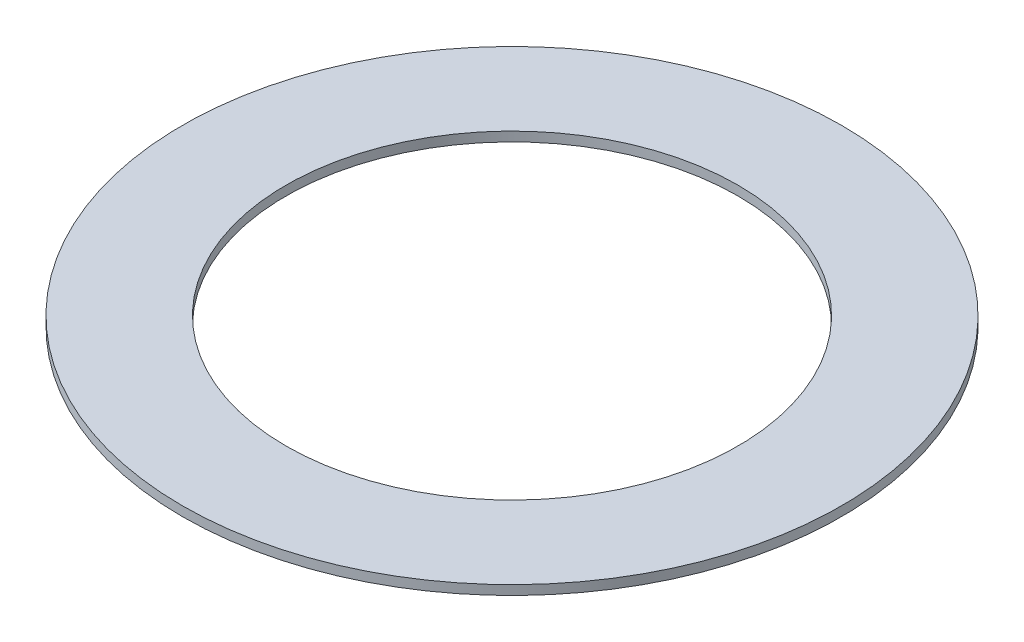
ISO-10303-21;
HEADER;
FILE_DESCRIPTION(('STEP AP214'),'2;1');
FILE_NAME('part.step','',(''),(''),'','','');
FILE_SCHEMA(('AUTOMOTIVE_DESIGN { 1 0 10303 214 1 1 1 1 }'));
ENDSEC;
DATA;
#1=APPLICATION_CONTEXT('core data for automotive mechanical design processes');
#2=APPLICATION_PROTOCOL_DEFINITION('international standard','automotive_design',2000,#1);
#3=PRODUCT_CONTEXT('',#1,'mechanical');
#4=PRODUCT('Part','Part','',(#3));
#5=PRODUCT_RELATED_PRODUCT_CATEGORY('part','',(#4));
#6=PRODUCT_DEFINITION_FORMATION('','',#4);
#7=PRODUCT_DEFINITION_CONTEXT('part definition',#1,'design');
#8=PRODUCT_DEFINITION('design','',#6,#7);
#9=PRODUCT_DEFINITION_SHAPE('','',#8);
#10=(LENGTH_UNIT() NAMED_UNIT(*) SI_UNIT(.MILLI.,.METRE.));
#11=(NAMED_UNIT(*) PLANE_ANGLE_UNIT() SI_UNIT($,.RADIAN.));
#12=(NAMED_UNIT(*) SI_UNIT($,.STERADIAN.) SOLID_ANGLE_UNIT());
#13=UNCERTAINTY_MEASURE_WITH_UNIT(LENGTH_MEASURE(1.E-05),#10,'distance_accuracy_value','');
#14=(GEOMETRIC_REPRESENTATION_CONTEXT(3) GLOBAL_UNCERTAINTY_ASSIGNED_CONTEXT((#13)) GLOBAL_UNIT_ASSIGNED_CONTEXT((#10,
#11,#12)) REPRESENTATION_CONTEXT('',''));
#15=CARTESIAN_POINT('',(0.,0.,0.));
#16=DIRECTION('',(0.,0.,1.));
#17=DIRECTION('',(1.,0.,0.));
#18=AXIS2_PLACEMENT_3D('',#15,#16,#17);
#19=CARTESIAN_POINT('',(0.,0.79375,0.));
#20=DIRECTION('',(0.,1.,0.));
#21=DIRECTION('',(0.,0.,1.));
#22=AXIS2_PLACEMENT_3D('',#19,#20,#21);
#23=PLANE('',#22);
#24=CARTESIAN_POINT('',(0.,0.79375,0.));
#25=DIRECTION('',(0.,1.,0.));
#26=DIRECTION('',(0.,0.,1.));
#27=AXIS2_PLACEMENT_3D('',#24,#25,#26);
#28=CIRCLE('',#27,27.78125);
#29=CARTESIAN_POINT('',(0.,0.79375,27.78125));
#30=VERTEX_POINT('',#29);
#31=EDGE_CURVE('E10',#30,#30,#28,.T.);
#32=ORIENTED_EDGE('',*,*,#31,.T.);
#33=EDGE_LOOP('',(#32));
#34=FACE_BOUND('',#33,.T.);
#35=CARTESIAN_POINT('',(0.,0.79375,0.));
#36=DIRECTION('',(0.,1.,0.));
#37=DIRECTION('',(0.,0.,1.));
#38=AXIS2_PLACEMENT_3D('',#35,#36,#37);
#39=CIRCLE('',#38,19.05);
#40=CARTESIAN_POINT('',(0.,0.79375,19.05));
#41=VERTEX_POINT('',#40);
#42=EDGE_CURVE('E39',#41,#41,#39,.T.);
#43=ORIENTED_EDGE('',*,*,#42,.F.);
#44=EDGE_LOOP('',(#43));
#45=FACE_BOUND('',#44,.T.);
#46=ADVANCED_FACE('F28',(#34,#45),#23,.T.);
#47=CARTESIAN_POINT('',(0.,0.,0.));
#48=DIRECTION('',(0.,1.,0.));
#49=DIRECTION('',(0.,0.,1.));
#50=AXIS2_PLACEMENT_3D('',#47,#48,#49);
#51=PLANE('',#50);
#52=CARTESIAN_POINT('',(0.,0.,0.));
#53=DIRECTION('',(0.,1.,0.));
#54=DIRECTION('',(0.,0.,1.));
#55=AXIS2_PLACEMENT_3D('',#52,#53,#54);
#56=CIRCLE('',#55,27.78125);
#57=CARTESIAN_POINT('',(0.,0.,27.78125));
#58=VERTEX_POINT('',#57);
#59=EDGE_CURVE('E32',#58,#58,#56,.T.);
#60=ORIENTED_EDGE('',*,*,#59,.F.);
#61=EDGE_LOOP('',(#60));
#62=FACE_BOUND('',#61,.T.);
#63=CARTESIAN_POINT('',(0.,0.,0.));
#64=DIRECTION('',(0.,1.,0.));
#65=DIRECTION('',(0.,0.,1.));
#66=AXIS2_PLACEMENT_3D('',#63,#64,#65);
#67=CIRCLE('',#66,19.05);
#68=CARTESIAN_POINT('',(0.,0.,19.05));
#69=VERTEX_POINT('',#68);
#70=EDGE_CURVE('E41',#69,#69,#67,.T.);
#71=ORIENTED_EDGE('',*,*,#70,.T.);
#72=EDGE_LOOP('',(#71));
#73=FACE_BOUND('',#72,.T.);
#74=ADVANCED_FACE('F51',(#62,#73),#51,.F.);
#75=CARTESIAN_POINT('',(0.,0.79375,0.));
#76=DIRECTION('',(0.,-1.,0.));
#77=DIRECTION('',(0.,0.,-1.));
#78=AXIS2_PLACEMENT_3D('',#75,#76,#77);
#79=CYLINDRICAL_SURFACE('',#78,27.78125);
#80=ORIENTED_EDGE('',*,*,#31,.F.);
#81=EDGE_LOOP('',(#80));
#82=FACE_BOUND('',#81,.T.);
#83=ORIENTED_EDGE('',*,*,#59,.T.);
#84=EDGE_LOOP('',(#83));
#85=FACE_BOUND('',#84,.T.);
#86=ADVANCED_FACE('F30',(#82,#85),#79,.T.);
#87=CARTESIAN_POINT('',(0.,0.79375,0.));
#88=DIRECTION('',(0.,-1.,0.));
#89=DIRECTION('',(0.,0.,-1.));
#90=AXIS2_PLACEMENT_3D('',#87,#88,#89);
#91=CYLINDRICAL_SURFACE('',#90,19.05);
#92=ORIENTED_EDGE('',*,*,#42,.T.);
#93=EDGE_LOOP('',(#92));
#94=FACE_BOUND('',#93,.T.);
#95=ORIENTED_EDGE('',*,*,#70,.F.);
#96=EDGE_LOOP('',(#95));
#97=FACE_BOUND('',#96,.T.);
#98=ADVANCED_FACE('F47',(#94,#97),#91,.F.);
#99=CLOSED_SHELL('',(#46,#74,#86,#98));
#100=MANIFOLD_SOLID_BREP('B2',#99);
#101=ADVANCED_BREP_SHAPE_REPRESENTATION('',(#18,#100),#14);
#102=SHAPE_DEFINITION_REPRESENTATION(#9,#101);
ENDSEC;
END-ISO-10303-21;
